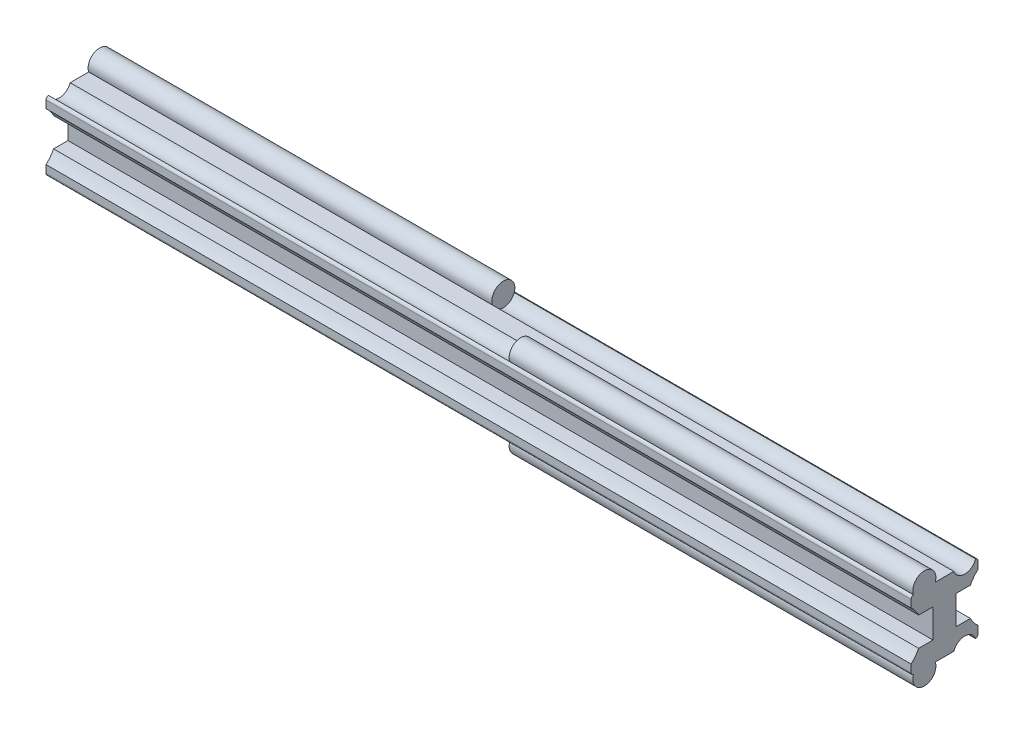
ISO-10303-21;
HEADER;
FILE_DESCRIPTION(('STEP AP214'),'2;1');
FILE_NAME('part.step','',(''),(''),'','','');
FILE_SCHEMA(('AUTOMOTIVE_DESIGN { 1 0 10303 214 1 1 1 1 }'));
ENDSEC;
DATA;
#1=APPLICATION_CONTEXT('core data for automotive mechanical design processes');
#2=APPLICATION_PROTOCOL_DEFINITION('international standard','automotive_design',2000,#1);
#3=PRODUCT_CONTEXT('',#1,'mechanical');
#4=PRODUCT('Part','Part','',(#3));
#5=PRODUCT_RELATED_PRODUCT_CATEGORY('part','',(#4));
#6=PRODUCT_DEFINITION_FORMATION('','',#4);
#7=PRODUCT_DEFINITION_CONTEXT('part definition',#1,'design');
#8=PRODUCT_DEFINITION('design','',#6,#7);
#9=PRODUCT_DEFINITION_SHAPE('','',#8);
#10=(LENGTH_UNIT() NAMED_UNIT(*) SI_UNIT(.MILLI.,.METRE.));
#11=(NAMED_UNIT(*) PLANE_ANGLE_UNIT() SI_UNIT($,.RADIAN.));
#12=(NAMED_UNIT(*) SI_UNIT($,.STERADIAN.) SOLID_ANGLE_UNIT());
#13=UNCERTAINTY_MEASURE_WITH_UNIT(LENGTH_MEASURE(1.E-05),#10,'distance_accuracy_value','');
#14=(GEOMETRIC_REPRESENTATION_CONTEXT(3) GLOBAL_UNCERTAINTY_ASSIGNED_CONTEXT((#13)) GLOBAL_UNIT_ASSIGNED_CONTEXT((#10,
#11,#12)) REPRESENTATION_CONTEXT('',''));
#15=CARTESIAN_POINT('',(0.,0.,0.));
#16=DIRECTION('',(0.,0.,1.));
#17=DIRECTION('',(1.,0.,0.));
#18=AXIS2_PLACEMENT_3D('',#15,#16,#17);
#19=CARTESIAN_POINT('',(40.,-6.65,3.5));
#20=DIRECTION('',(-1.,0.,0.));
#21=DIRECTION('',(0.,0.,1.));
#22=AXIS2_PLACEMENT_3D('',#19,#20,#21);
#23=CYLINDRICAL_SURFACE('',#22,2.);
#24=CARTESIAN_POINT('',(5.,-6.65,3.5));
#25=DIRECTION('',(1.,0.,0.));
#26=DIRECTION('',(0.,0.,-1.));
#27=AXIS2_PLACEMENT_3D('',#24,#25,#26);
#28=CIRCLE('',#27,2.);
#29=CARTESIAN_POINT('',(5.,-6.,1.60857196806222));
#30=VERTEX_POINT('',#29);
#31=CARTESIAN_POINT('',(5.,-5.99207212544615,5.38868496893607));
#32=VERTEX_POINT('',#31);
#33=EDGE_CURVE('E29',#30,#32,#28,.T.);
#34=ORIENTED_EDGE('',*,*,#33,.T.);
#35=DIRECTION('',(-1.,0.,0.));
#36=VECTOR('',#35,1.);
#37=CARTESIAN_POINT('',(0.,-5.99207212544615,5.38868496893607));
#38=LINE('',#37,#36);
#39=CARTESIAN_POINT('',(-75.,-5.99207212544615,5.38868496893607));
#40=VERTEX_POINT('',#39);
#41=EDGE_CURVE('E217',#32,#40,#38,.T.);
#42=ORIENTED_EDGE('',*,*,#41,.T.);
#43=CARTESIAN_POINT('',(-75.,-6.65,3.5));
#44=DIRECTION('',(1.,0.,0.));
#45=DIRECTION('',(0.,0.,1.));
#46=AXIS2_PLACEMENT_3D('',#43,#44,#45);
#47=CIRCLE('',#46,2.);
#48=CARTESIAN_POINT('',(-75.,-6.,1.60857196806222));
#49=VERTEX_POINT('',#48);
#50=EDGE_CURVE('E258',#49,#40,#47,.T.);
#51=ORIENTED_EDGE('',*,*,#50,.F.);
#52=DIRECTION('',(-1.,0.,0.));
#53=VECTOR('',#52,1.);
#54=CARTESIAN_POINT('',(40.,-6.,1.60857196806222));
#55=LINE('',#54,#53);
#56=EDGE_CURVE('E318',#49,#30,#55,.F.);
#57=ORIENTED_EDGE('',*,*,#56,.T.);
#58=EDGE_LOOP('',(#34,#42,#51,#57));
#59=FACE_BOUND('',#58,.T.);
#60=ADVANCED_FACE('F14',(#59),#23,.F.);
#61=CARTESIAN_POINT('',(40.,6.65,3.5));
#62=DIRECTION('',(-1.,0.,0.));
#63=DIRECTION('',(0.,0.,1.));
#64=AXIS2_PLACEMENT_3D('',#61,#62,#63);
#65=CYLINDRICAL_SURFACE('',#64,2.);
#66=CARTESIAN_POINT('',(5.,6.65,3.5));
#67=DIRECTION('',(1.,0.,0.));
#68=DIRECTION('',(0.,0.,-1.));
#69=AXIS2_PLACEMENT_3D('',#66,#67,#68);
#70=CIRCLE('',#69,2.);
#71=CARTESIAN_POINT('',(5.,5.99207212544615,5.38868496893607));
#72=VERTEX_POINT('',#71);
#73=CARTESIAN_POINT('',(5.,6.,1.60857196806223));
#74=VERTEX_POINT('',#73);
#75=EDGE_CURVE('E230',#72,#74,#70,.T.);
#76=ORIENTED_EDGE('',*,*,#75,.T.);
#77=DIRECTION('',(-1.,0.,0.));
#78=VECTOR('',#77,1.);
#79=CARTESIAN_POINT('',(40.,6.,1.60857196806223));
#80=LINE('',#79,#78);
#81=CARTESIAN_POINT('',(-75.,6.,1.60857196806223));
#82=VERTEX_POINT('',#81);
#83=EDGE_CURVE('E22',#74,#82,#80,.T.);
#84=ORIENTED_EDGE('',*,*,#83,.T.);
#85=CARTESIAN_POINT('',(-75.,6.65,3.5));
#86=DIRECTION('',(1.,0.,0.));
#87=DIRECTION('',(0.,0.,1.));
#88=AXIS2_PLACEMENT_3D('',#85,#86,#87);
#89=CIRCLE('',#88,2.);
#90=CARTESIAN_POINT('',(-75.,5.99207212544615,5.38868496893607));
#91=VERTEX_POINT('',#90);
#92=EDGE_CURVE('E288',#91,#82,#89,.T.);
#93=ORIENTED_EDGE('',*,*,#92,.F.);
#94=DIRECTION('',(-1.,0.,0.));
#95=VECTOR('',#94,1.);
#96=CARTESIAN_POINT('',(0.,5.99207212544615,5.38868496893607));
#97=LINE('',#96,#95);
#98=EDGE_CURVE('E382',#91,#72,#97,.F.);
#99=ORIENTED_EDGE('',*,*,#98,.T.);
#100=EDGE_LOOP('',(#76,#84,#93,#99));
#101=FACE_BOUND('',#100,.T.);
#102=ADVANCED_FACE('F488',(#101),#65,.F.);
#103=CARTESIAN_POINT('',(40.,-6.65,-3.5));
#104=DIRECTION('',(-1.,0.,0.));
#105=DIRECTION('',(0.,0.,1.));
#106=AXIS2_PLACEMENT_3D('',#103,#104,#105);
#107=CYLINDRICAL_SURFACE('',#106,2.);
#108=CARTESIAN_POINT('',(-5.,-6.65,-3.5));
#109=DIRECTION('',(-1.,0.,0.));
#110=DIRECTION('',(0.,0.,1.));
#111=AXIS2_PLACEMENT_3D('',#108,#109,#110);
#112=CIRCLE('',#111,2.);
#113=CARTESIAN_POINT('',(-5.,-6.,-1.60857196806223));
#114=VERTEX_POINT('',#113);
#115=CARTESIAN_POINT('',(-5.,-5.99207212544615,-5.38868496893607));
#116=VERTEX_POINT('',#115);
#117=EDGE_CURVE('E239',#114,#116,#112,.T.);
#118=ORIENTED_EDGE('',*,*,#117,.T.);
#119=DIRECTION('',(-1.,0.,0.));
#120=VECTOR('',#119,1.);
#121=CARTESIAN_POINT('',(0.,-5.99207212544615,-5.38868496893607));
#122=LINE('',#121,#120);
#123=CARTESIAN_POINT('',(75.,-5.99207212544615,-5.38868496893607));
#124=VERTEX_POINT('',#123);
#125=EDGE_CURVE('E376',#116,#124,#122,.F.);
#126=ORIENTED_EDGE('',*,*,#125,.T.);
#127=CARTESIAN_POINT('',(75.,-6.65,-3.5));
#128=DIRECTION('',(1.,0.,0.));
#129=DIRECTION('',(0.,0.,1.));
#130=AXIS2_PLACEMENT_3D('',#127,#128,#129);
#131=CIRCLE('',#130,2.);
#132=CARTESIAN_POINT('',(75.,-6.,-1.60857196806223));
#133=VERTEX_POINT('',#132);
#134=EDGE_CURVE('E321',#124,#133,#131,.T.);
#135=ORIENTED_EDGE('',*,*,#134,.T.);
#136=DIRECTION('',(-1.,0.,0.));
#137=VECTOR('',#136,1.);
#138=CARTESIAN_POINT('',(40.,-6.,-1.60857196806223));
#139=LINE('',#138,#137);
#140=EDGE_CURVE('E417',#133,#114,#139,.T.);
#141=ORIENTED_EDGE('',*,*,#140,.T.);
#142=EDGE_LOOP('',(#118,#126,#135,#141));
#143=FACE_BOUND('',#142,.T.);
#144=ADVANCED_FACE('F494',(#143),#107,.F.);
#145=CARTESIAN_POINT('',(40.,6.65,-3.5));
#146=DIRECTION('',(-1.,0.,0.));
#147=DIRECTION('',(0.,0.,1.));
#148=AXIS2_PLACEMENT_3D('',#145,#146,#147);
#149=CYLINDRICAL_SURFACE('',#148,2.);
#150=CARTESIAN_POINT('',(-5.,6.65,-3.5));
#151=DIRECTION('',(-1.,0.,0.));
#152=DIRECTION('',(0.,0.,1.));
#153=AXIS2_PLACEMENT_3D('',#150,#151,#152);
#154=CIRCLE('',#153,2.);
#155=CARTESIAN_POINT('',(-5.,5.99207212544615,-5.38868496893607));
#156=VERTEX_POINT('',#155);
#157=CARTESIAN_POINT('',(-5.,6.,-1.60857196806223));
#158=VERTEX_POINT('',#157);
#159=EDGE_CURVE('E245',#156,#158,#154,.T.);
#160=ORIENTED_EDGE('',*,*,#159,.T.);
#161=DIRECTION('',(-1.,0.,0.));
#162=VECTOR('',#161,1.);
#163=CARTESIAN_POINT('',(40.,6.,-1.60857196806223));
#164=LINE('',#163,#162);
#165=CARTESIAN_POINT('',(75.,6.,-1.60857196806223));
#166=VERTEX_POINT('',#165);
#167=EDGE_CURVE('E379',#158,#166,#164,.F.);
#168=ORIENTED_EDGE('',*,*,#167,.T.);
#169=CARTESIAN_POINT('',(75.,6.65,-3.5));
#170=DIRECTION('',(1.,0.,0.));
#171=DIRECTION('',(0.,0.,1.));
#172=AXIS2_PLACEMENT_3D('',#169,#170,#171);
#173=CIRCLE('',#172,2.);
#174=CARTESIAN_POINT('',(75.,5.99207212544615,-5.38868496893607));
#175=VERTEX_POINT('',#174);
#176=EDGE_CURVE('E349',#166,#175,#173,.T.);
#177=ORIENTED_EDGE('',*,*,#176,.T.);
#178=DIRECTION('',(-1.,0.,0.));
#179=VECTOR('',#178,1.);
#180=CARTESIAN_POINT('',(0.,5.99207212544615,-5.38868496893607));
#181=LINE('',#180,#179);
#182=EDGE_CURVE('E420',#175,#156,#181,.T.);
#183=ORIENTED_EDGE('',*,*,#182,.T.);
#184=EDGE_LOOP('',(#160,#168,#177,#183));
#185=FACE_BOUND('',#184,.T.);
#186=ADVANCED_FACE('F501',(#185),#149,.F.);
#187=CARTESIAN_POINT('',(-75.,-5.5,-5.3000000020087));
#188=DIRECTION('',(-1.,0.,0.));
#189=DIRECTION('',(0.,0.,1.));
#190=AXIS2_PLACEMENT_3D('',#187,#188,#189);
#191=PLANE('',#190);
#192=CARTESIAN_POINT('',(-75.,-5.5,-5.3000000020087));
#193=DIRECTION('',(-1.,0.,0.));
#194=DIRECTION('',(0.,0.,1.));
#195=AXIS2_PLACEMENT_3D('',#192,#193,#194);
#196=CIRCLE('',#195,0.5);
#197=CARTESIAN_POINT('',(-75.,-5.5,-5.8000000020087));
#198=VERTEX_POINT('',#197);
#199=CARTESIAN_POINT('',(-75.,-5.99207212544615,-5.38868496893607));
#200=VERTEX_POINT('',#199);
#201=EDGE_CURVE('E251',#198,#200,#196,.T.);
#202=ORIENTED_EDGE('',*,*,#201,.T.);
#203=CARTESIAN_POINT('',(-75.,-6.65,-3.5));
#204=DIRECTION('',(-1.,0.,0.));
#205=DIRECTION('',(0.,0.,1.));
#206=AXIS2_PLACEMENT_3D('',#203,#204,#205);
#207=CIRCLE('',#206,2.);
#208=CARTESIAN_POINT('',(-75.,-6.,-1.60857196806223));
#209=VERTEX_POINT('',#208);
#210=EDGE_CURVE('E238',#200,#209,#207,.T.);
#211=ORIENTED_EDGE('',*,*,#210,.T.);
#212=DIRECTION('',(0.,0.,1.));
#213=VECTOR('',#212,1.);
#214=CARTESIAN_POINT('',(-75.,-6.,-1.60857196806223));
#215=LINE('',#214,#213);
#216=EDGE_CURVE('E254',#209,#49,#215,.T.);
#217=ORIENTED_EDGE('',*,*,#216,.T.);
#218=ORIENTED_EDGE('',*,*,#50,.T.);
#219=CARTESIAN_POINT('',(-75.,-5.5,5.3000000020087));
#220=DIRECTION('',(-1.,0.,0.));
#221=DIRECTION('',(0.,0.,1.));
#222=AXIS2_PLACEMENT_3D('',#219,#220,#221);
#223=CIRCLE('',#222,0.5);
#224=CARTESIAN_POINT('',(-75.,-5.5,5.8000000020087));
#225=VERTEX_POINT('',#224);
#226=EDGE_CURVE('E261',#40,#225,#223,.T.);
#227=ORIENTED_EDGE('',*,*,#226,.T.);
#228=DIRECTION('',(0.,1.,0.));
#229=VECTOR('',#228,1.);
#230=CARTESIAN_POINT('',(-75.,-5.5,5.8000000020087));
#231=LINE('',#230,#229);
#232=CARTESIAN_POINT('',(-75.,-4.1995699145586,5.80000000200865));
#233=VERTEX_POINT('',#232);
#234=EDGE_CURVE('E264',#225,#233,#231,.T.);
#235=ORIENTED_EDGE('',*,*,#234,.T.);
#236=CARTESIAN_POINT('',(-75.,0.00400000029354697,9.49999999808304));
#237=DIRECTION('',(1.,0.,0.));
#238=DIRECTION('',(0.,0.,1.));
#239=AXIS2_PLACEMENT_3D('',#236,#237,#238);
#240=CIRCLE('',#239,5.6);
#241=CARTESIAN_POINT('',(-75.,-2.49600003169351,4.48901208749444));
#242=VERTEX_POINT('',#241);
#243=EDGE_CURVE('E267',#233,#242,#240,.T.);
#244=ORIENTED_EDGE('',*,*,#243,.T.);
#245=DIRECTION('',(0.,1.2851330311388E-08,-1.));
#246=VECTOR('',#245,1.);
#247=CARTESIAN_POINT('',(-75.,-2.49600003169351,4.48901208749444));
#248=LINE('',#247,#246);
#249=CARTESIAN_POINT('',(-75.,-2.4959999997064,1.99999999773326));
#250=VERTEX_POINT('',#249);
#251=EDGE_CURVE('E270',#242,#250,#248,.T.);
#252=ORIENTED_EDGE('',*,*,#251,.T.);
#253=DIRECTION('',(0.,1.,0.));
#254=VECTOR('',#253,1.);
#255=CARTESIAN_POINT('',(-75.,-2.4959999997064,1.99999999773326));
#256=LINE('',#255,#254);
#257=CARTESIAN_POINT('',(-75.,2.4959999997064,1.99999999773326));
#258=VERTEX_POINT('',#257);
#259=EDGE_CURVE('E273',#250,#258,#256,.T.);
#260=ORIENTED_EDGE('',*,*,#259,.T.);
#261=DIRECTION('',(0.,1.28513155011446E-08,1.));
#262=VECTOR('',#261,1.);
#263=CARTESIAN_POINT('',(-75.,2.4959999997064,1.99999999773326));
#264=LINE('',#263,#262);
#265=CARTESIAN_POINT('',(-75.,2.49600003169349,4.48901208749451));
#266=VERTEX_POINT('',#265);
#267=EDGE_CURVE('E276',#258,#266,#264,.T.);
#268=ORIENTED_EDGE('',*,*,#267,.T.);
#269=CARTESIAN_POINT('',(-75.,-0.00400000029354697,9.49999999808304));
#270=DIRECTION('',(1.,0.,0.));
#271=DIRECTION('',(0.,0.,1.));
#272=AXIS2_PLACEMENT_3D('',#269,#270,#271);
#273=CIRCLE('',#272,5.6);
#274=CARTESIAN_POINT('',(-75.,4.19956991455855,5.8000000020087));
#275=VERTEX_POINT('',#274);
#276=EDGE_CURVE('E279',#266,#275,#273,.T.);
#277=ORIENTED_EDGE('',*,*,#276,.T.);
#278=DIRECTION('',(0.,1.,0.));
#279=VECTOR('',#278,1.);
#280=CARTESIAN_POINT('',(-75.,4.19956991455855,5.8000000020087));
#281=LINE('',#280,#279);
#282=CARTESIAN_POINT('',(-75.,5.5,5.8000000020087));
#283=VERTEX_POINT('',#282);
#284=EDGE_CURVE('E282',#275,#283,#281,.T.);
#285=ORIENTED_EDGE('',*,*,#284,.T.);
#286=CARTESIAN_POINT('',(-75.,5.5,5.3000000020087));
#287=DIRECTION('',(-1.,0.,0.));
#288=DIRECTION('',(0.,0.,1.));
#289=AXIS2_PLACEMENT_3D('',#286,#287,#288);
#290=CIRCLE('',#289,0.5);
#291=EDGE_CURVE('E285',#283,#91,#290,.T.);
#292=ORIENTED_EDGE('',*,*,#291,.T.);
#293=ORIENTED_EDGE('',*,*,#92,.T.);
#294=DIRECTION('',(0.,0.,-1.));
#295=VECTOR('',#294,1.);
#296=CARTESIAN_POINT('',(-75.,6.,1.60857196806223));
#297=LINE('',#296,#295);
#298=CARTESIAN_POINT('',(-75.,6.,-1.60857196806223));
#299=VERTEX_POINT('',#298);
#300=EDGE_CURVE('E291',#82,#299,#297,.T.);
#301=ORIENTED_EDGE('',*,*,#300,.T.);
#302=CARTESIAN_POINT('',(-75.,6.65,-3.5));
#303=DIRECTION('',(-1.,0.,0.));
#304=DIRECTION('',(0.,0.,1.));
#305=AXIS2_PLACEMENT_3D('',#302,#303,#304);
#306=CIRCLE('',#305,2.);
#307=CARTESIAN_POINT('',(-75.,5.99207212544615,-5.38868496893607));
#308=VERTEX_POINT('',#307);
#309=EDGE_CURVE('E242',#299,#308,#306,.T.);
#310=ORIENTED_EDGE('',*,*,#309,.T.);
#311=CARTESIAN_POINT('',(-75.,5.5,-5.3000000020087));
#312=DIRECTION('',(-1.,0.,0.));
#313=DIRECTION('',(0.,0.,1.));
#314=AXIS2_PLACEMENT_3D('',#311,#312,#313);
#315=CIRCLE('',#314,0.5);
#316=CARTESIAN_POINT('',(-75.,5.5,-5.8000000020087));
#317=VERTEX_POINT('',#316);
#318=EDGE_CURVE('E294',#308,#317,#315,.T.);
#319=ORIENTED_EDGE('',*,*,#318,.T.);
#320=DIRECTION('',(0.,-1.,0.));
#321=VECTOR('',#320,1.);
#322=CARTESIAN_POINT('',(-75.,5.5,-5.8000000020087));
#323=LINE('',#322,#321);
#324=CARTESIAN_POINT('',(-75.,4.1995699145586,-5.80000000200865));
#325=VERTEX_POINT('',#324);
#326=EDGE_CURVE('E297',#317,#325,#323,.T.);
#327=ORIENTED_EDGE('',*,*,#326,.T.);
#328=CARTESIAN_POINT('',(-75.,-0.00400000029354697,-9.49999999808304));
#329=DIRECTION('',(1.,0.,0.));
#330=DIRECTION('',(0.,0.,1.));
#331=AXIS2_PLACEMENT_3D('',#328,#329,#330);
#332=CIRCLE('',#331,5.6);
#333=CARTESIAN_POINT('',(-75.,2.49600003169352,-4.48901208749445));
#334=VERTEX_POINT('',#333);
#335=EDGE_CURVE('E300',#325,#334,#332,.T.);
#336=ORIENTED_EDGE('',*,*,#335,.T.);
#337=DIRECTION('',(0.,-1.28513315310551E-08,1.));
#338=VECTOR('',#337,1.);
#339=CARTESIAN_POINT('',(-75.,2.49600003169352,-4.48901208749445));
#340=LINE('',#339,#338);
#341=CARTESIAN_POINT('',(-75.,2.4959999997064,-1.99999999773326));
#342=VERTEX_POINT('',#341);
#343=EDGE_CURVE('E303',#334,#342,#340,.T.);
#344=ORIENTED_EDGE('',*,*,#343,.T.);
#345=DIRECTION('',(0.,-1.,0.));
#346=VECTOR('',#345,1.);
#347=CARTESIAN_POINT('',(-75.,2.4959999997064,-1.99999999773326));
#348=LINE('',#347,#346);
#349=CARTESIAN_POINT('',(-75.,-2.4959999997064,-1.99999999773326));
#350=VERTEX_POINT('',#349);
#351=EDGE_CURVE('E306',#342,#350,#348,.T.);
#352=ORIENTED_EDGE('',*,*,#351,.T.);
#353=DIRECTION('',(0.,-1.28513155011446E-08,-1.));
#354=VECTOR('',#353,1.);
#355=CARTESIAN_POINT('',(-75.,-2.4959999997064,-1.99999999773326));
#356=LINE('',#355,#354);
#357=CARTESIAN_POINT('',(-75.,-2.49600003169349,-4.48901208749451));
#358=VERTEX_POINT('',#357);
#359=EDGE_CURVE('E309',#350,#358,#356,.T.);
#360=ORIENTED_EDGE('',*,*,#359,.T.);
#361=CARTESIAN_POINT('',(-75.,0.00400000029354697,-9.49999999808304));
#362=DIRECTION('',(1.,0.,0.));
#363=DIRECTION('',(0.,0.,1.));
#364=AXIS2_PLACEMENT_3D('',#361,#362,#363);
#365=CIRCLE('',#364,5.6);
#366=CARTESIAN_POINT('',(-75.,-4.19956991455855,-5.8000000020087));
#367=VERTEX_POINT('',#366);
#368=EDGE_CURVE('E312',#358,#367,#365,.T.);
#369=ORIENTED_EDGE('',*,*,#368,.T.);
#370=DIRECTION('',(0.,-1.,0.));
#371=VECTOR('',#370,1.);
#372=CARTESIAN_POINT('',(-75.,-4.19956991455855,-5.8000000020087));
#373=LINE('',#372,#371);
#374=EDGE_CURVE('E315',#367,#198,#373,.T.);
#375=ORIENTED_EDGE('',*,*,#374,.T.);
#376=EDGE_LOOP('',(#202,#211,#217,#218,#227,#235,#244,#252,#260,#268,#277,#285,#292,#293,#301,
#310,#319,#327,#336,#344,#352,#360,#369,#375));
#377=FACE_BOUND('',#376,.T.);
#378=ADVANCED_FACE('F435',(#377),#191,.T.);
#379=CARTESIAN_POINT('',(-40.,5.24599995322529,-5.80000000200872));
#380=DIRECTION('',(0.,0.,1.));
#381=DIRECTION('',(0.,1.,0.));
#382=AXIS2_PLACEMENT_3D('',#379,#380,#381);
#383=PLANE('',#382);
#384=DIRECTION('',(1.,0.,0.));
#385=VECTOR('',#384,1.);
#386=CARTESIAN_POINT('',(-40.,4.19956991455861,-5.80000000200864));
#387=LINE('',#386,#385);
#388=CARTESIAN_POINT('',(75.,4.1995699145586,-5.80000000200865));
#389=VERTEX_POINT('',#388);
#390=EDGE_CURVE('E415',#325,#389,#387,.T.);
#391=ORIENTED_EDGE('',*,*,#390,.F.);
#392=ORIENTED_EDGE('',*,*,#326,.F.);
#393=DIRECTION('',(-1.,0.,0.));
#394=VECTOR('',#393,1.);
#395=CARTESIAN_POINT('',(51.7056202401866,5.5,-5.8000000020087));
#396=LINE('',#395,#394);
#397=CARTESIAN_POINT('',(75.,5.5,-5.8000000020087));
#398=VERTEX_POINT('',#397);
#399=EDGE_CURVE('E390',#398,#317,#396,.T.);
#400=ORIENTED_EDGE('',*,*,#399,.F.);
#401=DIRECTION('',(0.,-1.,0.));
#402=VECTOR('',#401,1.);
#403=CARTESIAN_POINT('',(75.,5.5,-5.8000000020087));
#404=LINE('',#403,#402);
#405=EDGE_CURVE('E355',#398,#389,#404,.T.);
#406=ORIENTED_EDGE('',*,*,#405,.T.);
#407=EDGE_LOOP('',(#391,#392,#400,#406));
#408=FACE_BOUND('',#407,.T.);
#409=ADVANCED_FACE('F16',(#408),#383,.F.);
#410=CARTESIAN_POINT('',(-40.,-0.00400000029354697,-9.49999999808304));
#411=DIRECTION('',(1.,0.,0.));
#412=DIRECTION('',(0.,0.,-1.));
#413=AXIS2_PLACEMENT_3D('',#410,#411,#412);
#414=CYLINDRICAL_SURFACE('',#413,5.6);
#415=ORIENTED_EDGE('',*,*,#390,.T.);
#416=CARTESIAN_POINT('',(75.,-0.00400000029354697,-9.49999999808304));
#417=DIRECTION('',(1.,0.,0.));
#418=DIRECTION('',(0.,0.,1.));
#419=AXIS2_PLACEMENT_3D('',#416,#417,#418);
#420=CIRCLE('',#419,5.6);
#421=CARTESIAN_POINT('',(75.,2.49600003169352,-4.48901208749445));
#422=VERTEX_POINT('',#421);
#423=EDGE_CURVE('E358',#389,#422,#420,.T.);
#424=ORIENTED_EDGE('',*,*,#423,.T.);
#425=DIRECTION('',(1.,0.,0.));
#426=VECTOR('',#425,1.);
#427=CARTESIAN_POINT('',(-40.,2.49600003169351,-4.48901208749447));
#428=LINE('',#427,#426);
#429=EDGE_CURVE('E413',#334,#422,#428,.T.);
#430=ORIENTED_EDGE('',*,*,#429,.F.);
#431=ORIENTED_EDGE('',*,*,#335,.F.);
#432=EDGE_LOOP('',(#415,#424,#430,#431));
#433=FACE_BOUND('',#432,.T.);
#434=ADVANCED_FACE('F441',(#433),#414,.F.);
#435=CARTESIAN_POINT('',(-40.,2.49600003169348,-4.48901208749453));
#436=DIRECTION('',(0.,1.,1.28513155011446E-08));
#437=DIRECTION('',(0.,1.28513155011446E-08,-1.));
#438=AXIS2_PLACEMENT_3D('',#435,#436,#437);
#439=PLANE('',#438);
#440=ORIENTED_EDGE('',*,*,#429,.T.);
#441=DIRECTION('',(0.,-1.28513315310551E-08,1.));
#442=VECTOR('',#441,1.);
#443=CARTESIAN_POINT('',(75.,2.49600003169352,-4.48901208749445));
#444=LINE('',#443,#442);
#445=CARTESIAN_POINT('',(75.,2.4959999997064,-1.99999999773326));
#446=VERTEX_POINT('',#445);
#447=EDGE_CURVE('E361',#422,#446,#444,.T.);
#448=ORIENTED_EDGE('',*,*,#447,.T.);
#449=DIRECTION('',(1.,0.,0.));
#450=VECTOR('',#449,1.);
#451=CARTESIAN_POINT('',(-40.,2.4959999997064,-1.99999999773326));
#452=LINE('',#451,#450);
#453=EDGE_CURVE('E411',#342,#446,#452,.T.);
#454=ORIENTED_EDGE('',*,*,#453,.F.);
#455=ORIENTED_EDGE('',*,*,#343,.F.);
#456=EDGE_LOOP('',(#440,#448,#454,#455));
#457=FACE_BOUND('',#456,.T.);
#458=ADVANCED_FACE('F446',(#457),#439,.F.);
#459=CARTESIAN_POINT('',(-40.,2.4959999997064,-1.99999999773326));
#460=DIRECTION('',(0.,0.,1.));
#461=DIRECTION('',(1.,0.,0.));
#462=AXIS2_PLACEMENT_3D('',#459,#460,#461);
#463=PLANE('',#462);
#464=ORIENTED_EDGE('',*,*,#453,.T.);
#465=DIRECTION('',(0.,-1.,0.));
#466=VECTOR('',#465,1.);
#467=CARTESIAN_POINT('',(75.,2.4959999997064,-1.99999999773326));
#468=LINE('',#467,#466);
#469=CARTESIAN_POINT('',(75.,-2.4959999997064,-1.99999999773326));
#470=VERTEX_POINT('',#469);
#471=EDGE_CURVE('E364',#446,#470,#468,.T.);
#472=ORIENTED_EDGE('',*,*,#471,.T.);
#473=DIRECTION('',(1.,0.,0.));
#474=VECTOR('',#473,1.);
#475=CARTESIAN_POINT('',(-40.,-2.4959999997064,-1.99999999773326));
#476=LINE('',#475,#474);
#477=EDGE_CURVE('E409',#350,#470,#476,.T.);
#478=ORIENTED_EDGE('',*,*,#477,.F.);
#479=ORIENTED_EDGE('',*,*,#351,.F.);
#480=EDGE_LOOP('',(#464,#472,#478,#479));
#481=FACE_BOUND('',#480,.T.);
#482=ADVANCED_FACE('F449',(#481),#463,.F.);
#483=CARTESIAN_POINT('',(-40.,-2.49600003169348,-4.48901208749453));
#484=DIRECTION('',(0.,-1.,1.28513155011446E-08));
#485=DIRECTION('',(0.,1.28513155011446E-08,1.));
#486=AXIS2_PLACEMENT_3D('',#483,#484,#485);
#487=PLANE('',#486);
#488=ORIENTED_EDGE('',*,*,#477,.T.);
#489=DIRECTION('',(0.,-1.28513155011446E-08,-1.));
#490=VECTOR('',#489,1.);
#491=CARTESIAN_POINT('',(75.,-2.4959999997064,-1.99999999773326));
#492=LINE('',#491,#490);
#493=CARTESIAN_POINT('',(75.,-2.49600003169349,-4.48901208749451));
#494=VERTEX_POINT('',#493);
#495=EDGE_CURVE('E367',#470,#494,#492,.T.);
#496=ORIENTED_EDGE('',*,*,#495,.T.);
#497=DIRECTION('',(1.,0.,0.));
#498=VECTOR('',#497,1.);
#499=CARTESIAN_POINT('',(-40.,-2.49600003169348,-4.48901208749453));
#500=LINE('',#499,#498);
#501=EDGE_CURVE('E407',#358,#494,#500,.T.);
#502=ORIENTED_EDGE('',*,*,#501,.F.);
#503=ORIENTED_EDGE('',*,*,#359,.F.);
#504=EDGE_LOOP('',(#488,#496,#502,#503));
#505=FACE_BOUND('',#504,.T.);
#506=ADVANCED_FACE('F454',(#505),#487,.F.);
#507=CARTESIAN_POINT('',(-40.,0.00400000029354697,-9.49999999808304));
#508=DIRECTION('',(1.,0.,0.));
#509=DIRECTION('',(0.,0.,-1.));
#510=AXIS2_PLACEMENT_3D('',#507,#508,#509);
#511=CYLINDRICAL_SURFACE('',#510,5.6);
#512=ORIENTED_EDGE('',*,*,#501,.T.);
#513=CARTESIAN_POINT('',(75.,0.00400000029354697,-9.49999999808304));
#514=DIRECTION('',(1.,0.,0.));
#515=DIRECTION('',(0.,0.,1.));
#516=AXIS2_PLACEMENT_3D('',#513,#514,#515);
#517=CIRCLE('',#516,5.6);
#518=CARTESIAN_POINT('',(75.,-4.19956991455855,-5.8000000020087));
#519=VERTEX_POINT('',#518);
#520=EDGE_CURVE('E370',#494,#519,#517,.T.);
#521=ORIENTED_EDGE('',*,*,#520,.T.);
#522=DIRECTION('',(1.,0.,0.));
#523=VECTOR('',#522,1.);
#524=CARTESIAN_POINT('',(-40.,-4.19956991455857,-5.80000000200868));
#525=LINE('',#524,#523);
#526=EDGE_CURVE('E405',#367,#519,#525,.T.);
#527=ORIENTED_EDGE('',*,*,#526,.F.);
#528=ORIENTED_EDGE('',*,*,#368,.F.);
#529=EDGE_LOOP('',(#512,#521,#527,#528));
#530=FACE_BOUND('',#529,.T.);
#531=ADVANCED_FACE('F457',(#530),#511,.F.);
#532=CARTESIAN_POINT('',(-40.,-5.24599995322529,-5.80000000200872));
#533=DIRECTION('',(0.,0.,1.));
#534=DIRECTION('',(0.,1.,0.));
#535=AXIS2_PLACEMENT_3D('',#532,#533,#534);
#536=PLANE('',#535);
#537=ORIENTED_EDGE('',*,*,#526,.T.);
#538=DIRECTION('',(0.,-1.,0.));
#539=VECTOR('',#538,1.);
#540=CARTESIAN_POINT('',(75.,-4.19956991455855,-5.8000000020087));
#541=LINE('',#540,#539);
#542=CARTESIAN_POINT('',(75.,-5.5,-5.8000000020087));
#543=VERTEX_POINT('',#542);
#544=EDGE_CURVE('E255',#519,#543,#541,.T.);
#545=ORIENTED_EDGE('',*,*,#544,.T.);
#546=DIRECTION('',(-1.,0.,0.));
#547=VECTOR('',#546,1.);
#548=CARTESIAN_POINT('',(51.7056202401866,-5.5,-5.8000000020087));
#549=LINE('',#548,#547);
#550=EDGE_CURVE('E385',#543,#198,#549,.T.);
#551=ORIENTED_EDGE('',*,*,#550,.T.);
#552=ORIENTED_EDGE('',*,*,#374,.F.);
#553=EDGE_LOOP('',(#537,#545,#551,#552));
#554=FACE_BOUND('',#553,.T.);
#555=ADVANCED_FACE('F462',(#554),#536,.F.);
#556=CARTESIAN_POINT('',(-40.,-5.24599995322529,5.80000000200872));
#557=DIRECTION('',(0.,0.,-1.));
#558=DIRECTION('',(0.,-1.,0.));
#559=AXIS2_PLACEMENT_3D('',#556,#557,#558);
#560=PLANE('',#559);
#561=DIRECTION('',(1.,0.,0.));
#562=VECTOR('',#561,1.);
#563=CARTESIAN_POINT('',(-40.,-4.19956991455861,5.80000000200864));
#564=LINE('',#563,#562);
#565=CARTESIAN_POINT('',(75.,-4.1995699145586,5.80000000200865));
#566=VERTEX_POINT('',#565);
#567=EDGE_CURVE('E403',#233,#566,#564,.T.);
#568=ORIENTED_EDGE('',*,*,#567,.F.);
#569=ORIENTED_EDGE('',*,*,#234,.F.);
#570=DIRECTION('',(-1.,0.,0.));
#571=VECTOR('',#570,1.);
#572=CARTESIAN_POINT('',(51.7056202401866,-5.5,5.8000000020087));
#573=LINE('',#572,#571);
#574=CARTESIAN_POINT('',(75.,-5.5,5.8000000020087));
#575=VERTEX_POINT('',#574);
#576=EDGE_CURVE('E387',#575,#225,#573,.T.);
#577=ORIENTED_EDGE('',*,*,#576,.F.);
#578=DIRECTION('',(0.,1.,0.));
#579=VECTOR('',#578,1.);
#580=CARTESIAN_POINT('',(75.,-5.5,5.8000000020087));
#581=LINE('',#580,#579);
#582=EDGE_CURVE('E209',#575,#566,#581,.T.);
#583=ORIENTED_EDGE('',*,*,#582,.T.);
#584=EDGE_LOOP('',(#568,#569,#577,#583));
#585=FACE_BOUND('',#584,.T.);
#586=ADVANCED_FACE('F544',(#585),#560,.F.);
#587=CARTESIAN_POINT('',(-40.,0.00400000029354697,9.49999999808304));
#588=DIRECTION('',(1.,0.,0.));
#589=DIRECTION('',(0.,0.,-1.));
#590=AXIS2_PLACEMENT_3D('',#587,#588,#589);
#591=CYLINDRICAL_SURFACE('',#590,5.6);
#592=ORIENTED_EDGE('',*,*,#567,.T.);
#593=CARTESIAN_POINT('',(75.,0.00400000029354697,9.49999999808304));
#594=DIRECTION('',(1.,0.,0.));
#595=DIRECTION('',(0.,0.,1.));
#596=AXIS2_PLACEMENT_3D('',#593,#594,#595);
#597=CIRCLE('',#596,5.6);
#598=CARTESIAN_POINT('',(75.,-2.49600003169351,4.48901208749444));
#599=VERTEX_POINT('',#598);
#600=EDGE_CURVE('E326',#566,#599,#597,.T.);
#601=ORIENTED_EDGE('',*,*,#600,.T.);
#602=DIRECTION('',(1.,0.,0.));
#603=VECTOR('',#602,1.);
#604=CARTESIAN_POINT('',(-40.,-2.49600003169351,4.48901208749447));
#605=LINE('',#604,#603);
#606=EDGE_CURVE('E401',#242,#599,#605,.T.);
#607=ORIENTED_EDGE('',*,*,#606,.F.);
#608=ORIENTED_EDGE('',*,*,#243,.F.);
#609=EDGE_LOOP('',(#592,#601,#607,#608));
#610=FACE_BOUND('',#609,.T.);
#611=ADVANCED_FACE('F540',(#610),#591,.F.);
#612=CARTESIAN_POINT('',(-40.,-2.49600003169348,4.48901208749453));
#613=DIRECTION('',(0.,-1.,-1.28513155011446E-08));
#614=DIRECTION('',(0.,-1.28513155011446E-08,1.));
#615=AXIS2_PLACEMENT_3D('',#612,#613,#614);
#616=PLANE('',#615);
#617=ORIENTED_EDGE('',*,*,#606,.T.);
#618=DIRECTION('',(0.,1.2851330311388E-08,-1.));
#619=VECTOR('',#618,1.);
#620=CARTESIAN_POINT('',(75.,-2.49600003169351,4.48901208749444));
#621=LINE('',#620,#619);
#622=CARTESIAN_POINT('',(75.,-2.4959999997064,1.99999999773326));
#623=VERTEX_POINT('',#622);
#624=EDGE_CURVE('E329',#599,#623,#621,.T.);
#625=ORIENTED_EDGE('',*,*,#624,.T.);
#626=DIRECTION('',(1.,0.,0.));
#627=VECTOR('',#626,1.);
#628=CARTESIAN_POINT('',(-40.,-2.4959999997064,1.99999999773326));
#629=LINE('',#628,#627);
#630=EDGE_CURVE('E399',#250,#623,#629,.T.);
#631=ORIENTED_EDGE('',*,*,#630,.F.);
#632=ORIENTED_EDGE('',*,*,#251,.F.);
#633=EDGE_LOOP('',(#617,#625,#631,#632));
#634=FACE_BOUND('',#633,.T.);
#635=ADVANCED_FACE('F536',(#634),#616,.F.);
#636=CARTESIAN_POINT('',(-40.,2.4959999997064,1.99999999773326));
#637=DIRECTION('',(0.,0.,-1.));
#638=DIRECTION('',(-1.,0.,0.));
#639=AXIS2_PLACEMENT_3D('',#636,#637,#638);
#640=PLANE('',#639);
#641=ORIENTED_EDGE('',*,*,#630,.T.);
#642=DIRECTION('',(0.,1.,0.));
#643=VECTOR('',#642,1.);
#644=CARTESIAN_POINT('',(75.,-2.4959999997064,1.99999999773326));
#645=LINE('',#644,#643);
#646=CARTESIAN_POINT('',(75.,2.4959999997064,1.99999999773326));
#647=VERTEX_POINT('',#646);
#648=EDGE_CURVE('E332',#623,#647,#645,.T.);
#649=ORIENTED_EDGE('',*,*,#648,.T.);
#650=DIRECTION('',(1.,0.,0.));
#651=VECTOR('',#650,1.);
#652=CARTESIAN_POINT('',(-40.,2.4959999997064,1.99999999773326));
#653=LINE('',#652,#651);
#654=EDGE_CURVE('E397',#258,#647,#653,.T.);
#655=ORIENTED_EDGE('',*,*,#654,.F.);
#656=ORIENTED_EDGE('',*,*,#259,.F.);
#657=EDGE_LOOP('',(#641,#649,#655,#656));
#658=FACE_BOUND('',#657,.T.);
#659=ADVANCED_FACE('F532',(#658),#640,.F.);
#660=CARTESIAN_POINT('',(-40.,2.49600003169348,4.48901208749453));
#661=DIRECTION('',(0.,1.,-1.28513155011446E-08));
#662=DIRECTION('',(0.,-1.28513155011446E-08,-1.));
#663=AXIS2_PLACEMENT_3D('',#660,#661,#662);
#664=PLANE('',#663);
#665=ORIENTED_EDGE('',*,*,#654,.T.);
#666=DIRECTION('',(0.,1.28513155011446E-08,1.));
#667=VECTOR('',#666,1.);
#668=CARTESIAN_POINT('',(75.,2.4959999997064,1.99999999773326));
#669=LINE('',#668,#667);
#670=CARTESIAN_POINT('',(75.,2.49600003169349,4.48901208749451));
#671=VERTEX_POINT('',#670);
#672=EDGE_CURVE('E335',#647,#671,#669,.T.);
#673=ORIENTED_EDGE('',*,*,#672,.T.);
#674=DIRECTION('',(1.,0.,0.));
#675=VECTOR('',#674,1.);
#676=CARTESIAN_POINT('',(-40.,2.49600003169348,4.48901208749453));
#677=LINE('',#676,#675);
#678=EDGE_CURVE('E395',#266,#671,#677,.T.);
#679=ORIENTED_EDGE('',*,*,#678,.F.);
#680=ORIENTED_EDGE('',*,*,#267,.F.);
#681=EDGE_LOOP('',(#665,#673,#679,#680));
#682=FACE_BOUND('',#681,.T.);
#683=ADVANCED_FACE('F528',(#682),#664,.F.);
#684=CARTESIAN_POINT('',(-40.,-0.00400000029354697,9.49999999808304));
#685=DIRECTION('',(1.,0.,0.));
#686=DIRECTION('',(0.,0.,-1.));
#687=AXIS2_PLACEMENT_3D('',#684,#685,#686);
#688=CYLINDRICAL_SURFACE('',#687,5.6);
#689=ORIENTED_EDGE('',*,*,#678,.T.);
#690=CARTESIAN_POINT('',(75.,-0.00400000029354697,9.49999999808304));
#691=DIRECTION('',(1.,0.,0.));
#692=DIRECTION('',(0.,0.,1.));
#693=AXIS2_PLACEMENT_3D('',#690,#691,#692);
#694=CIRCLE('',#693,5.6);
#695=CARTESIAN_POINT('',(75.,4.19956991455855,5.8000000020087));
#696=VERTEX_POINT('',#695);
#697=EDGE_CURVE('E338',#671,#696,#694,.T.);
#698=ORIENTED_EDGE('',*,*,#697,.T.);
#699=DIRECTION('',(1.,0.,0.));
#700=VECTOR('',#699,1.);
#701=CARTESIAN_POINT('',(-40.,4.19956991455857,5.80000000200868));
#702=LINE('',#701,#700);
#703=EDGE_CURVE('E392',#275,#696,#702,.T.);
#704=ORIENTED_EDGE('',*,*,#703,.F.);
#705=ORIENTED_EDGE('',*,*,#276,.F.);
#706=EDGE_LOOP('',(#689,#698,#704,#705));
#707=FACE_BOUND('',#706,.T.);
#708=ADVANCED_FACE('F524',(#707),#688,.F.);
#709=CARTESIAN_POINT('',(-40.,5.24599995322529,5.80000000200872));
#710=DIRECTION('',(0.,0.,-1.));
#711=DIRECTION('',(0.,-1.,0.));
#712=AXIS2_PLACEMENT_3D('',#709,#710,#711);
#713=PLANE('',#712);
#714=ORIENTED_EDGE('',*,*,#703,.T.);
#715=DIRECTION('',(0.,1.,0.));
#716=VECTOR('',#715,1.);
#717=CARTESIAN_POINT('',(75.,4.19956991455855,5.8000000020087));
#718=LINE('',#717,#716);
#719=CARTESIAN_POINT('',(75.,5.5,5.8000000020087));
#720=VERTEX_POINT('',#719);
#721=EDGE_CURVE('E341',#696,#720,#718,.T.);
#722=ORIENTED_EDGE('',*,*,#721,.T.);
#723=DIRECTION('',(-1.,0.,0.));
#724=VECTOR('',#723,1.);
#725=CARTESIAN_POINT('',(51.7056202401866,5.5,5.8000000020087));
#726=LINE('',#725,#724);
#727=EDGE_CURVE('E389',#720,#283,#726,.T.);
#728=ORIENTED_EDGE('',*,*,#727,.T.);
#729=ORIENTED_EDGE('',*,*,#284,.F.);
#730=EDGE_LOOP('',(#714,#722,#728,#729));
#731=FACE_BOUND('',#730,.T.);
#732=ADVANCED_FACE('F520',(#731),#713,.F.);
#733=CARTESIAN_POINT('',(51.7056202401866,5.5,5.3000000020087));
#734=DIRECTION('',(-1.,0.,0.));
#735=DIRECTION('',(0.,0.,1.));
#736=AXIS2_PLACEMENT_3D('',#733,#734,#735);
#737=CYLINDRICAL_SURFACE('',#736,0.5);
#738=ORIENTED_EDGE('',*,*,#98,.F.);
#739=ORIENTED_EDGE('',*,*,#291,.F.);
#740=ORIENTED_EDGE('',*,*,#727,.F.);
#741=CARTESIAN_POINT('',(75.,5.5,5.3000000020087));
#742=DIRECTION('',(-1.,0.,0.));
#743=DIRECTION('',(0.,0.,1.));
#744=AXIS2_PLACEMENT_3D('',#741,#742,#743);
#745=CIRCLE('',#744,0.5);
#746=CARTESIAN_POINT('',(75.,5.99207212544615,5.38868496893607));
#747=VERTEX_POINT('',#746);
#748=EDGE_CURVE('E344',#720,#747,#745,.T.);
#749=ORIENTED_EDGE('',*,*,#748,.T.);
#750=DIRECTION('',(1.,0.,0.));
#751=VECTOR('',#750,1.);
#752=CARTESIAN_POINT('',(40.,5.99207212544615,5.38868496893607));
#753=LINE('',#752,#751);
#754=EDGE_CURVE('E232',#72,#747,#753,.T.);
#755=ORIENTED_EDGE('',*,*,#754,.F.);
#756=EDGE_LOOP('',(#738,#739,#740,#749,#755));
#757=FACE_BOUND('',#756,.T.);
#758=ADVANCED_FACE('F516',(#757),#737,.T.);
#759=CARTESIAN_POINT('',(51.7056202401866,6.,-5.3000000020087));
#760=DIRECTION('',(0.,1.,0.));
#761=DIRECTION('',(-1.,0.,0.));
#762=AXIS2_PLACEMENT_3D('',#759,#760,#761);
#763=PLANE('',#762);
#764=CARTESIAN_POINT('',(75.,6.,1.60857196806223));
#765=VERTEX_POINT('',#764);
#766=EDGE_CURVE('E9',#765,#74,#80,.T.);
#767=ORIENTED_EDGE('',*,*,#766,.F.);
#768=DIRECTION('',(0.,0.,-1.));
#769=VECTOR('',#768,1.);
#770=CARTESIAN_POINT('',(75.,6.,1.60857196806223));
#771=LINE('',#770,#769);
#772=EDGE_CURVE('E346',#765,#166,#771,.T.);
#773=ORIENTED_EDGE('',*,*,#772,.T.);
#774=ORIENTED_EDGE('',*,*,#167,.F.);
#775=EDGE_CURVE('E380',#299,#158,#164,.F.);
#776=ORIENTED_EDGE('',*,*,#775,.F.);
#777=ORIENTED_EDGE('',*,*,#300,.F.);
#778=ORIENTED_EDGE('',*,*,#83,.F.);
#779=EDGE_LOOP('',(#767,#773,#774,#776,#777,#778));
#780=FACE_BOUND('',#779,.T.);
#781=ADVANCED_FACE('F513',(#780),#763,.T.);
#782=CARTESIAN_POINT('',(51.7056202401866,5.5,-5.3000000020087));
#783=DIRECTION('',(-1.,0.,0.));
#784=DIRECTION('',(0.,0.,1.));
#785=AXIS2_PLACEMENT_3D('',#782,#783,#784);
#786=CYLINDRICAL_SURFACE('',#785,0.5);
#787=ORIENTED_EDGE('',*,*,#182,.F.);
#788=CARTESIAN_POINT('',(75.,5.5,-5.3000000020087));
#789=DIRECTION('',(-1.,0.,0.));
#790=DIRECTION('',(0.,0.,1.));
#791=AXIS2_PLACEMENT_3D('',#788,#789,#790);
#792=CIRCLE('',#791,0.5);
#793=EDGE_CURVE('E352',#175,#398,#792,.T.);
#794=ORIENTED_EDGE('',*,*,#793,.T.);
#795=ORIENTED_EDGE('',*,*,#399,.T.);
#796=ORIENTED_EDGE('',*,*,#318,.F.);
#797=EDGE_CURVE('E419',#156,#308,#181,.T.);
#798=ORIENTED_EDGE('',*,*,#797,.F.);
#799=EDGE_LOOP('',(#787,#794,#795,#796,#798));
#800=FACE_BOUND('',#799,.T.);
#801=ADVANCED_FACE('F432',(#800),#786,.T.);
#802=CARTESIAN_POINT('',(51.7056202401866,-5.5,-5.3000000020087));
#803=DIRECTION('',(-1.,0.,0.));
#804=DIRECTION('',(0.,0.,1.));
#805=AXIS2_PLACEMENT_3D('',#802,#803,#804);
#806=CYLINDRICAL_SURFACE('',#805,0.5);
#807=EDGE_CURVE('E377',#200,#116,#122,.F.);
#808=ORIENTED_EDGE('',*,*,#807,.F.);
#809=ORIENTED_EDGE('',*,*,#201,.F.);
#810=ORIENTED_EDGE('',*,*,#550,.F.);
#811=CARTESIAN_POINT('',(75.,-5.5,-5.3000000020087));
#812=DIRECTION('',(-1.,0.,0.));
#813=DIRECTION('',(0.,0.,1.));
#814=AXIS2_PLACEMENT_3D('',#811,#812,#813);
#815=CIRCLE('',#814,0.5);
#816=EDGE_CURVE('E248',#543,#124,#815,.T.);
#817=ORIENTED_EDGE('',*,*,#816,.T.);
#818=ORIENTED_EDGE('',*,*,#125,.F.);
#819=EDGE_LOOP('',(#808,#809,#810,#817,#818));
#820=FACE_BOUND('',#819,.T.);
#821=ADVANCED_FACE('F465',(#820),#806,.T.);
#822=CARTESIAN_POINT('',(51.7056202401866,-6.,-5.3000000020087));
#823=DIRECTION('',(0.,-1.,0.));
#824=DIRECTION('',(1.,0.,0.));
#825=AXIS2_PLACEMENT_3D('',#822,#823,#824);
#826=PLANE('',#825);
#827=ORIENTED_EDGE('',*,*,#140,.F.);
#828=DIRECTION('',(0.,0.,1.));
#829=VECTOR('',#828,1.);
#830=CARTESIAN_POINT('',(75.,-6.,-1.60857196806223));
#831=LINE('',#830,#829);
#832=CARTESIAN_POINT('',(75.,-6.,1.60857196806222));
#833=VERTEX_POINT('',#832);
#834=EDGE_CURVE('E211',#133,#833,#831,.T.);
#835=ORIENTED_EDGE('',*,*,#834,.T.);
#836=DIRECTION('',(1.,0.,0.));
#837=VECTOR('',#836,1.);
#838=CARTESIAN_POINT('',(5.,-6.,1.60857196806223));
#839=LINE('',#838,#837);
#840=EDGE_CURVE('E37',#30,#833,#839,.T.);
#841=ORIENTED_EDGE('',*,*,#840,.F.);
#842=ORIENTED_EDGE('',*,*,#56,.F.);
#843=ORIENTED_EDGE('',*,*,#216,.F.);
#844=EDGE_CURVE('E221',#114,#209,#139,.T.);
#845=ORIENTED_EDGE('',*,*,#844,.F.);
#846=EDGE_LOOP('',(#827,#835,#841,#842,#843,#845));
#847=FACE_BOUND('',#846,.T.);
#848=ADVANCED_FACE('F475',(#847),#826,.T.);
#849=CARTESIAN_POINT('',(51.7056202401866,-5.5,5.3000000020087));
#850=DIRECTION('',(-1.,0.,0.));
#851=DIRECTION('',(0.,0.,1.));
#852=AXIS2_PLACEMENT_3D('',#849,#850,#851);
#853=CYLINDRICAL_SURFACE('',#852,0.5);
#854=CARTESIAN_POINT('',(75.,-5.99207212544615,5.38868496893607));
#855=VERTEX_POINT('',#854);
#856=EDGE_CURVE('E214',#855,#32,#38,.T.);
#857=ORIENTED_EDGE('',*,*,#856,.F.);
#858=CARTESIAN_POINT('',(75.,-5.5,5.3000000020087));
#859=DIRECTION('',(-1.,0.,0.));
#860=DIRECTION('',(0.,0.,1.));
#861=AXIS2_PLACEMENT_3D('',#858,#859,#860);
#862=CIRCLE('',#861,0.5);
#863=EDGE_CURVE('E200',#855,#575,#862,.T.);
#864=ORIENTED_EDGE('',*,*,#863,.T.);
#865=ORIENTED_EDGE('',*,*,#576,.T.);
#866=ORIENTED_EDGE('',*,*,#226,.F.);
#867=ORIENTED_EDGE('',*,*,#41,.F.);
#868=EDGE_LOOP('',(#857,#864,#865,#866,#867));
#869=FACE_BOUND('',#868,.T.);
#870=ADVANCED_FACE('F215',(#869),#853,.T.);
#871=CARTESIAN_POINT('',(75.,-5.5,-5.3000000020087));
#872=DIRECTION('',(-1.,0.,0.));
#873=DIRECTION('',(0.,0.,1.));
#874=AXIS2_PLACEMENT_3D('',#871,#872,#873);
#875=PLANE('',#874);
#876=ORIENTED_EDGE('',*,*,#816,.F.);
#877=ORIENTED_EDGE('',*,*,#544,.F.);
#878=ORIENTED_EDGE('',*,*,#520,.F.);
#879=ORIENTED_EDGE('',*,*,#495,.F.);
#880=ORIENTED_EDGE('',*,*,#471,.F.);
#881=ORIENTED_EDGE('',*,*,#447,.F.);
#882=ORIENTED_EDGE('',*,*,#423,.F.);
#883=ORIENTED_EDGE('',*,*,#405,.F.);
#884=ORIENTED_EDGE('',*,*,#793,.F.);
#885=ORIENTED_EDGE('',*,*,#176,.F.);
#886=ORIENTED_EDGE('',*,*,#772,.F.);
#887=CARTESIAN_POINT('',(75.,6.65,3.5));
#888=DIRECTION('',(1.,0.,0.));
#889=DIRECTION('',(0.,0.,-1.));
#890=AXIS2_PLACEMENT_3D('',#887,#888,#889);
#891=CIRCLE('',#890,2.);
#892=EDGE_CURVE('E229',#765,#747,#891,.T.);
#893=ORIENTED_EDGE('',*,*,#892,.T.);
#894=ORIENTED_EDGE('',*,*,#748,.F.);
#895=ORIENTED_EDGE('',*,*,#721,.F.);
#896=ORIENTED_EDGE('',*,*,#697,.F.);
#897=ORIENTED_EDGE('',*,*,#672,.F.);
#898=ORIENTED_EDGE('',*,*,#648,.F.);
#899=ORIENTED_EDGE('',*,*,#624,.F.);
#900=ORIENTED_EDGE('',*,*,#600,.F.);
#901=ORIENTED_EDGE('',*,*,#582,.F.);
#902=ORIENTED_EDGE('',*,*,#863,.F.);
#903=CARTESIAN_POINT('',(75.,-6.65,3.5));
#904=DIRECTION('',(1.,0.,0.));
#905=DIRECTION('',(0.,0.,-1.));
#906=AXIS2_PLACEMENT_3D('',#903,#904,#905);
#907=CIRCLE('',#906,2.);
#908=EDGE_CURVE('E206',#855,#833,#907,.T.);
#909=ORIENTED_EDGE('',*,*,#908,.T.);
#910=ORIENTED_EDGE('',*,*,#834,.F.);
#911=ORIENTED_EDGE('',*,*,#134,.F.);
#912=EDGE_LOOP('',(#876,#877,#878,#879,#880,#881,#882,#883,#884,#885,#886,#893,#894,#895,#896,
#897,#898,#899,#900,#901,#902,#909,#910,#911));
#913=FACE_BOUND('',#912,.T.);
#914=ADVANCED_FACE('F203',(#913),#875,.F.);
#915=CARTESIAN_POINT('',(-5.,6.65,-3.5));
#916=DIRECTION('',(-1.,0.,0.));
#917=DIRECTION('',(0.,0.,1.));
#918=AXIS2_PLACEMENT_3D('',#915,#916,#917);
#919=CYLINDRICAL_SURFACE('',#918,2.);
#920=ORIENTED_EDGE('',*,*,#309,.F.);
#921=ORIENTED_EDGE('',*,*,#775,.T.);
#922=EDGE_CURVE('E249',#158,#156,#154,.T.);
#923=ORIENTED_EDGE('',*,*,#922,.T.);
#924=ORIENTED_EDGE('',*,*,#797,.T.);
#925=EDGE_LOOP('',(#920,#921,#923,#924));
#926=FACE_BOUND('',#925,.T.);
#927=ADVANCED_FACE('F427',(#926),#919,.T.);
#928=CARTESIAN_POINT('',(-5.,6.65,-3.5));
#929=DIRECTION('',(-1.,0.,0.));
#930=DIRECTION('',(0.,0.,1.));
#931=AXIS2_PLACEMENT_3D('',#928,#929,#930);
#932=PLANE('',#931);
#933=ORIENTED_EDGE('',*,*,#159,.F.);
#934=ORIENTED_EDGE('',*,*,#922,.F.);
#935=EDGE_LOOP('',(#933,#934));
#936=FACE_BOUND('',#935,.T.);
#937=ADVANCED_FACE('F578',(#936),#932,.F.);
#938=CARTESIAN_POINT('',(-5.,-6.65,-3.5));
#939=DIRECTION('',(-1.,0.,0.));
#940=DIRECTION('',(0.,0.,1.));
#941=AXIS2_PLACEMENT_3D('',#938,#939,#940);
#942=CYLINDRICAL_SURFACE('',#941,2.);
#943=ORIENTED_EDGE('',*,*,#210,.F.);
#944=ORIENTED_EDGE('',*,*,#807,.T.);
#945=EDGE_CURVE('E243',#116,#114,#112,.T.);
#946=ORIENTED_EDGE('',*,*,#945,.T.);
#947=ORIENTED_EDGE('',*,*,#844,.T.);
#948=EDGE_LOOP('',(#943,#944,#946,#947));
#949=FACE_BOUND('',#948,.T.);
#950=ADVANCED_FACE('F472',(#949),#942,.T.);
#951=CARTESIAN_POINT('',(-5.,-6.65,-3.5));
#952=DIRECTION('',(-1.,0.,0.));
#953=DIRECTION('',(0.,0.,1.));
#954=AXIS2_PLACEMENT_3D('',#951,#952,#953);
#955=PLANE('',#954);
#956=ORIENTED_EDGE('',*,*,#117,.F.);
#957=ORIENTED_EDGE('',*,*,#945,.F.);
#958=EDGE_LOOP('',(#956,#957));
#959=FACE_BOUND('',#958,.T.);
#960=ADVANCED_FACE('F588',(#959),#955,.F.);
#961=CARTESIAN_POINT('',(5.,6.65,3.5));
#962=DIRECTION('',(1.,0.,0.));
#963=DIRECTION('',(0.,0.,-1.));
#964=AXIS2_PLACEMENT_3D('',#961,#962,#963);
#965=CYLINDRICAL_SURFACE('',#964,2.);
#966=EDGE_CURVE('E233',#74,#72,#70,.T.);
#967=ORIENTED_EDGE('',*,*,#966,.T.);
#968=ORIENTED_EDGE('',*,*,#754,.T.);
#969=ORIENTED_EDGE('',*,*,#892,.F.);
#970=ORIENTED_EDGE('',*,*,#766,.T.);
#971=EDGE_LOOP('',(#967,#968,#969,#970));
#972=FACE_BOUND('',#971,.T.);
#973=ADVANCED_FACE('F593',(#972),#965,.T.);
#974=CARTESIAN_POINT('',(5.,6.65,3.5));
#975=DIRECTION('',(1.,0.,0.));
#976=DIRECTION('',(0.,0.,-1.));
#977=AXIS2_PLACEMENT_3D('',#974,#975,#976);
#978=PLANE('',#977);
#979=ORIENTED_EDGE('',*,*,#75,.F.);
#980=ORIENTED_EDGE('',*,*,#966,.F.);
#981=EDGE_LOOP('',(#979,#980));
#982=FACE_BOUND('',#981,.T.);
#983=ADVANCED_FACE('F485',(#982),#978,.F.);
#984=CARTESIAN_POINT('',(5.,-6.65,3.5));
#985=DIRECTION('',(1.,0.,0.));
#986=DIRECTION('',(0.,0.,-1.));
#987=AXIS2_PLACEMENT_3D('',#984,#985,#986);
#988=CYLINDRICAL_SURFACE('',#987,2.);
#989=EDGE_CURVE('E224',#32,#30,#28,.T.);
#990=ORIENTED_EDGE('',*,*,#989,.T.);
#991=ORIENTED_EDGE('',*,*,#840,.T.);
#992=ORIENTED_EDGE('',*,*,#908,.F.);
#993=ORIENTED_EDGE('',*,*,#856,.T.);
#994=EDGE_LOOP('',(#990,#991,#992,#993));
#995=FACE_BOUND('',#994,.T.);
#996=ADVANCED_FACE('F223',(#995),#988,.T.);
#997=CARTESIAN_POINT('',(5.,-6.65,3.5));
#998=DIRECTION('',(1.,0.,0.));
#999=DIRECTION('',(0.,0.,-1.));
#1000=AXIS2_PLACEMENT_3D('',#997,#998,#999);
#1001=PLANE('',#1000);
#1002=ORIENTED_EDGE('',*,*,#33,.F.);
#1003=ORIENTED_EDGE('',*,*,#989,.F.);
#1004=EDGE_LOOP('',(#1002,#1003));
#1005=FACE_BOUND('',#1004,.T.);
#1006=ADVANCED_FACE('F477',(#1005),#1001,.F.);
#1007=CLOSED_SHELL('',(#60,#102,#144,#186,#378,#409,#434,#458,#482,#506,#531,#555,#586,#611,
#635,#659,#683,#708,#732,#758,#781,#801,#821,#848,#870,#914,#927,#937,#950,#960,#973,#983,#996,#1006));
#1008=MANIFOLD_SOLID_BREP('B1',#1007);
#1009=ADVANCED_BREP_SHAPE_REPRESENTATION('',(#18,#1008),#14);
#1010=SHAPE_DEFINITION_REPRESENTATION(#9,#1009);
ENDSEC;
END-ISO-10303-21;
